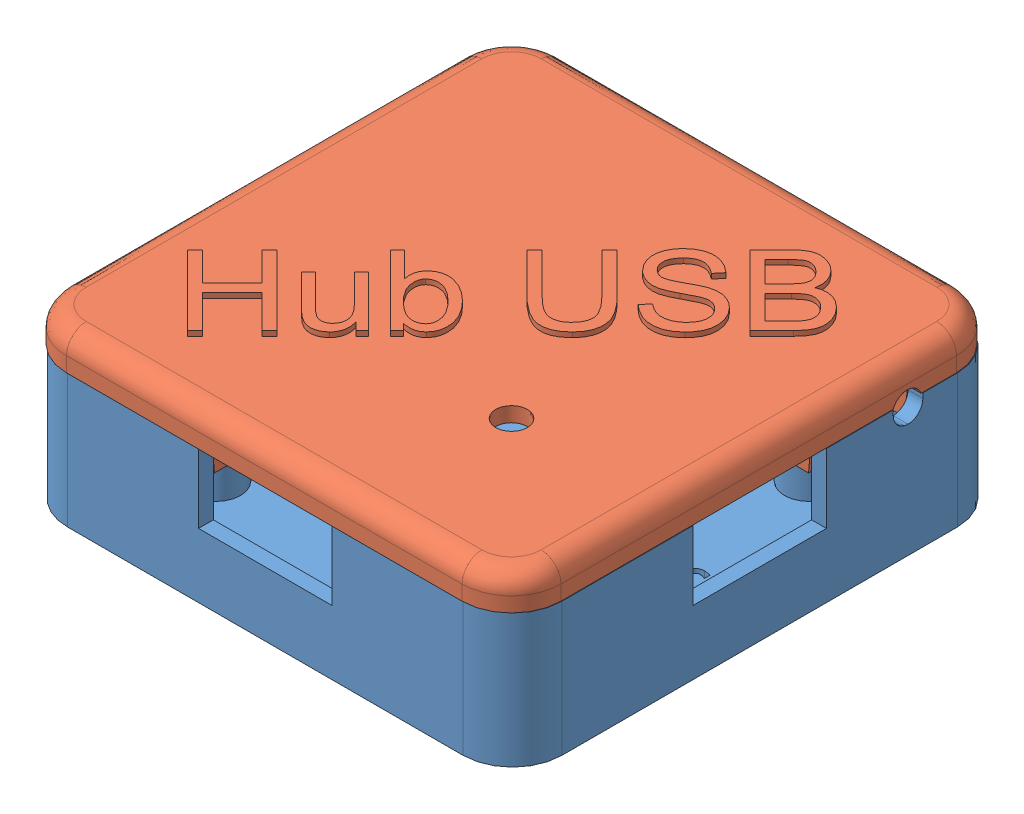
SolidWorks assembly Boitier_UB-USB.SLDASM, configuration Défaut (file format 6000). Lengths in mm.
Overall size (58.82 17.5 55.88).
2 component instances, 2 part files, 3 mates.
Components (placement in the parent):
- BoitierUB-USB-Fond-1: BoitierUB-USB-Fond.SLDPRT [Défaut] at (103.015 -6.3686 -26.6693) size (50 13.5 50)
- BoitierUB-USB-Couvercle-1: BoitierUB-USB-Couvercle.SLDPRT [Défaut] at (102.965 10.6314 28.7193) x (1 0 0) z (0 0 -1) size (58.82 7 55.88)
Mates (geometry in assembly coordinates):
- Coïncidente1: coincident: plane of BoitierUB-USB-Fond-1 through (-52.1568 7.1314 -22.5) normal (0 0 1); line of BoitierUB-USB-Couvercle-1 through (-12.1568 7.1314 -22.5) axis (-1 0 0)
- Coïncidente2: coincident: plane of BoitierUB-USB-Fond-1 through (-8.6568 7.1314 -19) normal (-1 0 0); line of BoitierUB-USB-Couvercle-1 through (-8.6568 7.1314 -5.7) axis (0 0 -1)
- Coïncidente3: coincident anti-aligned: plane of BoitierUB-USB-Fond-1 through (-52.1568 7.1314 21) normal (0 1 0); plane of BoitierUB-USB-Couvercle-1 through (-52.2068 7.1314 -18.95) normal (0 -1 0)
